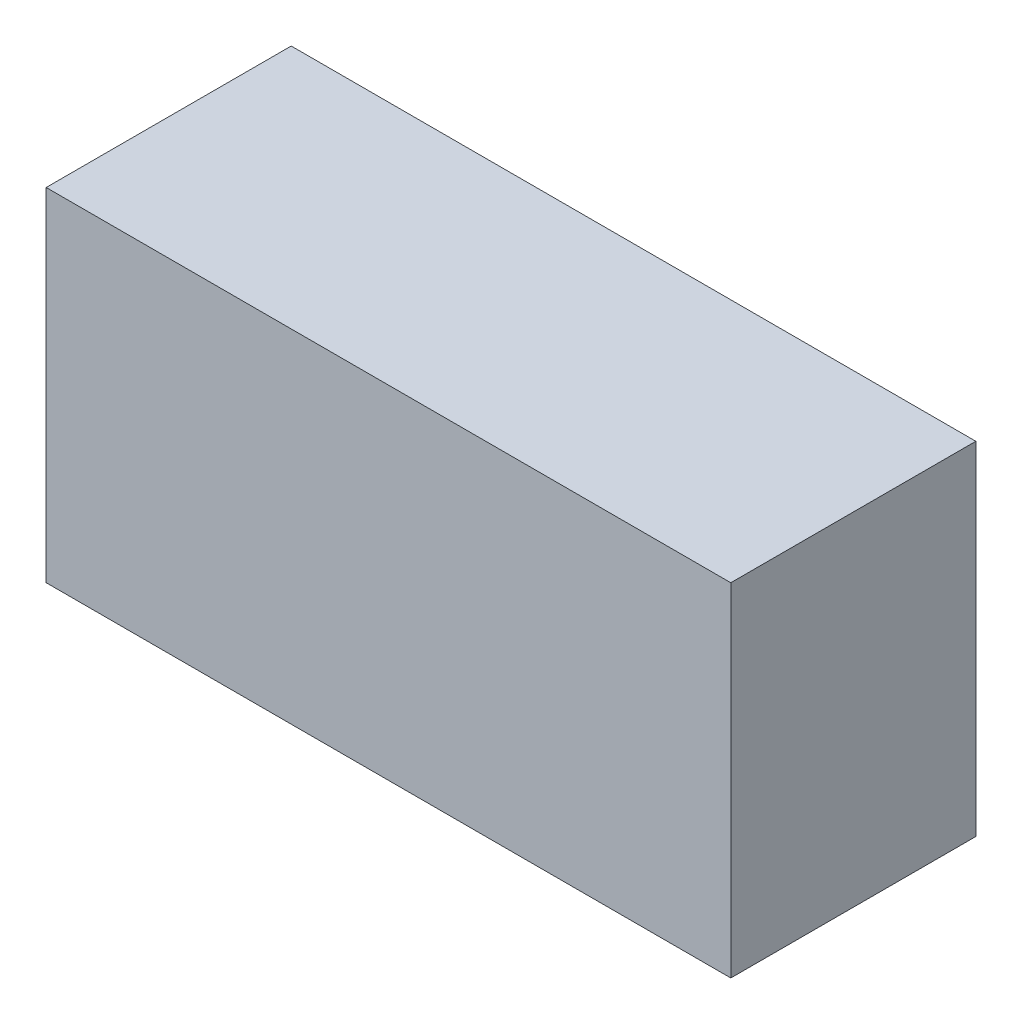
from build123d import *

# Parameters (mm, degrees)
COMPONENT_OUTLINE_W = 1.1176
COMPONENT_OUTLINE_H = 0.5588
BOSS_EXTRUDE1_DEPTH = 0.4


with BuildPart() as part:
    # Component_Outline → Boss-Extrude1 (new body)
    with BuildSketch(Plane.XY):
        Rectangle(COMPONENT_OUTLINE_W, COMPONENT_OUTLINE_H)
    extrude(amount=BOSS_EXTRUDE1_DEPTH)


solid = part.part
